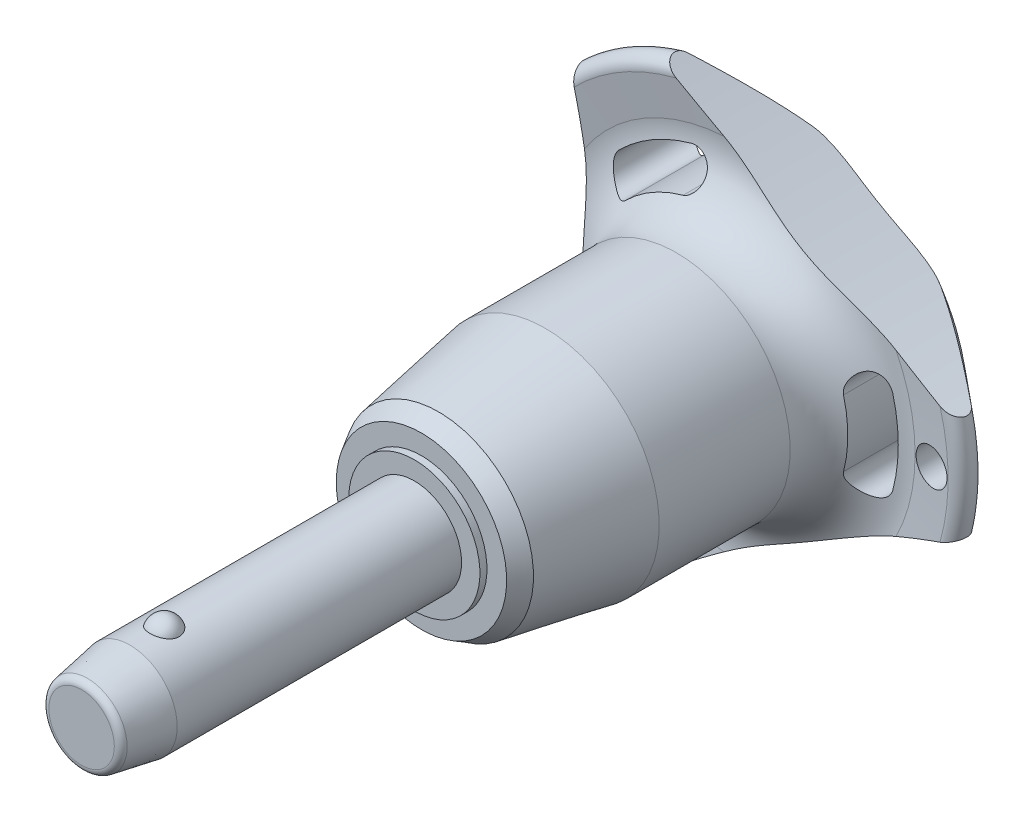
from build123d import *

# Parameters (mm, degrees)
SKETCH1_R           = 4
BOSS_EXTRUDE1_DEPTH = 20
SKETCH2_R           = 3.4
BOSS_EXTRUDE2_DEPTH = 33.3
BOSS_EXTRUDE3_START = 8.2
SKETCH1_2_R         = 4
BOSS_EXTRUDE3_DEPTH = 8.2
CHAMFER1_SIZE       = 4.1
CHAMFER1_SIZE2      = 0.722940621
FILLET1_R           = 0.6
SKETCH6_R           = 102.8
CUT_EXTRUDE1_DEPTH  = 61.079897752
CIRPATTERN1_COUNT   = 3
SKETCH7_R           = 1.5
CUT_EXTRUDE2_DEPTH  = 60.810087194


with BuildPart() as part:
    # Sketch1 → Boss-Extrude1 (new body)
    with BuildSketch(Plane.XY):
        Circle(SKETCH1_R)
    extrude(amount=-BOSS_EXTRUDE1_DEPTH)

    # Sketch2 → Boss-Extrude2 (add)
    with BuildSketch(Plane(origin=(0, 0, -20), x_dir=(-1, 0, 0), z_dir=(0, 0, -1))):
        Circle(SKETCH2_R)
    extrude(amount=BOSS_EXTRUDE2_DEPTH)

    # Sketch3 → Revolve1 (revolve)
    with BuildSketch(Plane(origin=(0, 0, 0), x_dir=(0, 0, -1), z_dir=(1, 0, 0))):
        with BuildLine():
            Line((-1.2, 4.8), (-1.2, 2.2))
            ThreePointArc((-1.2, 2.2), (0.1, 3.5), (-1.2, 4.8))
        make_face()
        with BuildLine():
            Line((-1.2, -2.2), (-1.2, -4.8))
            ThreePointArc((-1.2, -4.8), (0.1, -3.5), (-1.2, -2.2))
        make_face()
    revolve(axis=Axis((0, -2.2, 1.2), (0, 1, 0)))

    # Sketch1_2 → Boss-Extrude3 (add)
    with BuildSketch(Plane.XY.offset(BOSS_EXTRUDE3_START)):
        Circle(SKETCH1_2_R)
    extrude(amount=-BOSS_EXTRUDE3_DEPTH)

    # Chamfer1
    chamfer1_edges = [part.edges().sort_by_distance(p)[0] for p in [
        (-4, 0, 8.2),
    ]]
    chamfer1_side = [part.faces().sort_by_distance(p)[0] for p in [
        (-4, 0, -5.9),
    ]]
    chamfer(chamfer1_edges, length=CHAMFER1_SIZE, length2=CHAMFER1_SIZE2, reference=chamfer1_side[0])

    # Fillet1
    fillet1_edges = [part.edges().sort_by_distance(p)[0] for p in [
        (-3.277059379, 0, 8.2),
        (3.4, 0, -53.3),
    ]]
    fillet(fillet1_edges, radius=FILLET1_R)

    # Sketch4 → Revolve2 (revolve)
    with BuildSketch(Plane(origin=(0, 0, 0), x_dir=(0, 0, -1), z_dir=(1, 0, 0)), mode=Mode.PRIVATE) as revolve2_sk:
        Polygon((20, 0), (20, 5.554101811), (20.6, 5.554101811), (20.6, 7.220004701), (22.042714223, 8.052956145), (31.1, 9.65), (42.2, 9.65), (42.2, 0), align=None)
    revolve(revolve2_sk.sketch.rotate(Axis((0, 0, -42.2), (0, 0, 1)), 90), axis=Axis((0, 0, -42.2), (0, 0, 1)))

    # Sketch5 → Revolve3 (revolve)
    with BuildSketch(Plane(origin=(0, 0, 0), x_dir=(0, 0, -1), z_dir=(1, 0, 0)), mode=Mode.PRIVATE) as revolve3_sk:
        with BuildLine():
            Line((47.16082631, 15.274661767), (46.757834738, 18.475067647))
            ThreePointArc((46.757834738, 18.475067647), (47.349836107, 19.516443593), (48.516044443, 19.24278761))
            Line((48.516044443, 19.24278761), (52.835691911, 14.094832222))
            ThreePointArc((52.835691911, 14.094832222), (53.3, 12.689260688), (52.67067517, 11.349423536))
            ThreePointArc((52.67067517, 11.349423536), (49.033110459, 6.185112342), (47.75, 0))
            Line((47.75, 0), (42.2, 0))
            Line((42.2, 0), (42.2, 9.65))
            ThreePointArc((42.2, 9.65), (45.949887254, 11.342683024), (47.16082631, 15.274661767))
        make_face()
    revolve(revolve3_sk.sketch.rotate(Axis((0, 0, -47.75), (0, 0, 1)), 90), axis=Axis((0, 0, -47.75), (0, 0, 1)))

    # Sketch6 → Cut-Extrude1 (cut, through all)
    with BuildSketch(Plane.XY):
        with Locations((-115.2, 0)):
            Circle(SKETCH6_R)
        with BuildLine():
            ThreePointArc((13.411913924, -3.529271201), (13.868496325, 0), (13.411913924, 3.529271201))
            ThreePointArc((13.411913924, 3.529271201), (11.694200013, 4.531299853), (10.692171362, 2.813585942))
            ThreePointArc((10.692171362, 2.813585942), (11.056165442, 0), (10.692171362, -2.813585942))
            ThreePointArc((10.692171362, -2.813585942), (11.694200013, -4.531299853), (13.411913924, -3.529271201))
        make_face()
    cut_extrude1 = extrude(amount=-CUT_EXTRUDE1_DEPTH, mode=Mode.SUBTRACT)

    # CirPattern1: Cut-Extrude1 ×3 about axis
    cirpattern1_axis = Axis((0, 0, 0), (0, 0, 1))
    for i in range(1, CIRPATTERN1_COUNT):
        add(cut_extrude1.rotate(cirpattern1_axis, i * 360 / CIRPATTERN1_COUNT), mode=Mode.SUBTRACT)

    # Sketch7 → Cut-Extrude2 (cut, through all)
    with BuildSketch(Plane.XY):
        with Locations(Location((16.868496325, 0, 0), (0, 0, 225.467095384))):
            Circle(SKETCH7_R)
    extrude(amount=-CUT_EXTRUDE2_DEPTH, mode=Mode.SUBTRACT)


solid = part.part
